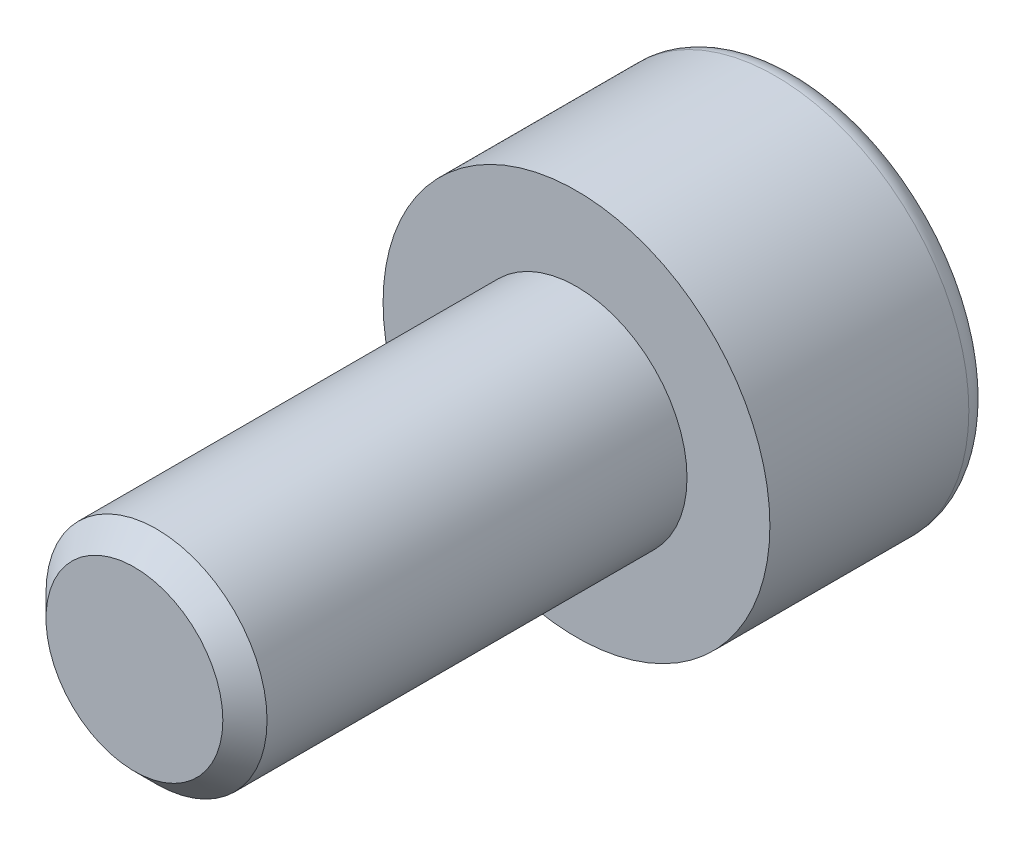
ISO-10303-21;
HEADER;
FILE_DESCRIPTION(('STEP AP214'),'2;1');
FILE_NAME('part.step','',(''),(''),'','','');
FILE_SCHEMA(('AUTOMOTIVE_DESIGN { 1 0 10303 214 1 1 1 1 }'));
ENDSEC;
DATA;
#1=APPLICATION_CONTEXT('core data for automotive mechanical design processes');
#2=APPLICATION_PROTOCOL_DEFINITION('international standard','automotive_design',2000,#1);
#3=PRODUCT_CONTEXT('',#1,'mechanical');
#4=PRODUCT('Part','Part','',(#3));
#5=PRODUCT_RELATED_PRODUCT_CATEGORY('part','',(#4));
#6=PRODUCT_DEFINITION_FORMATION('','',#4);
#7=PRODUCT_DEFINITION_CONTEXT('part definition',#1,'design');
#8=PRODUCT_DEFINITION('design','',#6,#7);
#9=PRODUCT_DEFINITION_SHAPE('','',#8);
#10=(LENGTH_UNIT() NAMED_UNIT(*) SI_UNIT(.MILLI.,.METRE.));
#11=(NAMED_UNIT(*) PLANE_ANGLE_UNIT() SI_UNIT($,.RADIAN.));
#12=(NAMED_UNIT(*) SI_UNIT($,.STERADIAN.) SOLID_ANGLE_UNIT());
#13=UNCERTAINTY_MEASURE_WITH_UNIT(LENGTH_MEASURE(1.E-05),#10,'distance_accuracy_value','');
#14=(GEOMETRIC_REPRESENTATION_CONTEXT(3) GLOBAL_UNCERTAINTY_ASSIGNED_CONTEXT((#13)) GLOBAL_UNIT_ASSIGNED_CONTEXT((#10,
#11,#12)) REPRESENTATION_CONTEXT('',''));
#15=CARTESIAN_POINT('',(0.,0.,0.));
#16=DIRECTION('',(0.,0.,1.));
#17=DIRECTION('',(1.,0.,0.));
#18=AXIS2_PLACEMENT_3D('',#15,#16,#17);
#19=CARTESIAN_POINT('',(0.,0.,-4.));
#20=DIRECTION('',(0.,0.,1.));
#21=DIRECTION('',(1.,0.,0.));
#22=AXIS2_PLACEMENT_3D('',#19,#20,#21);
#23=PLANE('',#22);
#24=CARTESIAN_POINT('',(0.,0.,-4.));
#25=DIRECTION('',(0.,0.,-1.));
#26=DIRECTION('',(-1.,0.,0.));
#27=AXIS2_PLACEMENT_3D('',#24,#25,#26);
#28=CIRCLE('',#27,3.1);
#29=CARTESIAN_POINT('',(-3.1,0.,-4.));
#30=VERTEX_POINT('',#29);
#31=EDGE_CURVE('E138',#30,#30,#28,.T.);
#32=ORIENTED_EDGE('',*,*,#31,.T.);
#33=EDGE_LOOP('',(#32));
#34=FACE_BOUND('',#33,.T.);
#35=DIRECTION('',(-0.86602540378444,0.499999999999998,0.));
#36=VECTOR('',#35,1.);
#37=CARTESIAN_POINT('',(0.,1.73205080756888,-4.));
#38=LINE('',#37,#36);
#39=CARTESIAN_POINT('',(1.5,0.866025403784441,-4.));
#40=VERTEX_POINT('',#39);
#41=CARTESIAN_POINT('',(0.,1.73205080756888,-4.));
#42=VERTEX_POINT('',#41);
#43=EDGE_CURVE('E42',#40,#42,#38,.T.);
#44=ORIENTED_EDGE('',*,*,#43,.T.);
#45=DIRECTION('',(-0.866025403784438,-0.500000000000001,0.));
#46=VECTOR('',#45,1.);
#47=CARTESIAN_POINT('',(0.,1.73205080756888,-4.));
#48=LINE('',#47,#46);
#49=CARTESIAN_POINT('',(-1.5,0.866025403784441,-4.));
#50=VERTEX_POINT('',#49);
#51=EDGE_CURVE('E82',#42,#50,#48,.T.);
#52=ORIENTED_EDGE('',*,*,#51,.T.);
#53=DIRECTION('',(0.,-1.,0.));
#54=VECTOR('',#53,1.);
#55=CARTESIAN_POINT('',(-1.5,-0.866025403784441,-4.));
#56=LINE('',#55,#54);
#57=CARTESIAN_POINT('',(-1.5,-0.866025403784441,-4.));
#58=VERTEX_POINT('',#57);
#59=EDGE_CURVE('E90',#50,#58,#56,.T.);
#60=ORIENTED_EDGE('',*,*,#59,.T.);
#61=DIRECTION('',(0.866025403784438,-0.500000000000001,0.));
#62=VECTOR('',#61,1.);
#63=CARTESIAN_POINT('',(0.,-1.73205080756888,-4.));
#64=LINE('',#63,#62);
#65=CARTESIAN_POINT('',(0.,-1.73205080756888,-4.));
#66=VERTEX_POINT('',#65);
#67=EDGE_CURVE('E108',#58,#66,#64,.T.);
#68=ORIENTED_EDGE('',*,*,#67,.T.);
#69=DIRECTION('',(0.86602540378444,0.499999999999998,0.));
#70=VECTOR('',#69,1.);
#71=CARTESIAN_POINT('',(0.,-1.73205080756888,-4.));
#72=LINE('',#71,#70);
#73=CARTESIAN_POINT('',(1.5,-0.866025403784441,-4.));
#74=VERTEX_POINT('',#73);
#75=EDGE_CURVE('E111',#66,#74,#72,.T.);
#76=ORIENTED_EDGE('',*,*,#75,.T.);
#77=DIRECTION('',(0.,1.,0.));
#78=VECTOR('',#77,1.);
#79=CARTESIAN_POINT('',(1.5,-0.866025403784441,-4.));
#80=LINE('',#79,#78);
#81=EDGE_CURVE('E101',#74,#40,#80,.T.);
#82=ORIENTED_EDGE('',*,*,#81,.T.);
#83=EDGE_LOOP('',(#44,#52,#60,#68,#76,#82));
#84=FACE_BOUND('',#83,.T.);
#85=ADVANCED_FACE('F28',(#34,#84),#23,.F.);
#86=CARTESIAN_POINT('',(0.,0.,-3.6));
#87=DIRECTION('',(0.,0.,-1.));
#88=DIRECTION('',(-1.,0.,0.));
#89=AXIS2_PLACEMENT_3D('',#86,#87,#88);
#90=TOROIDAL_SURFACE('',#89,3.1,0.4);
#91=ORIENTED_EDGE('',*,*,#31,.F.);
#92=EDGE_LOOP('',(#91));
#93=FACE_BOUND('',#92,.T.);
#94=CARTESIAN_POINT('',(0.,0.,-3.6));
#95=DIRECTION('',(0.,0.,-1.));
#96=DIRECTION('',(-1.,0.,0.));
#97=AXIS2_PLACEMENT_3D('',#94,#95,#96);
#98=CIRCLE('',#97,3.5);
#99=CARTESIAN_POINT('',(-3.5,0.,-3.6));
#100=VERTEX_POINT('',#99);
#101=EDGE_CURVE('E135',#100,#100,#98,.T.);
#102=ORIENTED_EDGE('',*,*,#101,.T.);
#103=EDGE_LOOP('',(#102));
#104=FACE_BOUND('',#103,.T.);
#105=ADVANCED_FACE('F157',(#93,#104),#90,.T.);
#106=CARTESIAN_POINT('',(0.,0.,0.));
#107=DIRECTION('',(0.,0.,-1.));
#108=DIRECTION('',(-1.,0.,0.));
#109=AXIS2_PLACEMENT_3D('',#106,#107,#108);
#110=CYLINDRICAL_SURFACE('',#109,3.5);
#111=ORIENTED_EDGE('',*,*,#101,.F.);
#112=EDGE_LOOP('',(#111));
#113=FACE_BOUND('',#112,.T.);
#114=CARTESIAN_POINT('',(0.,0.,0.));
#115=DIRECTION('',(0.,0.,-1.));
#116=DIRECTION('',(-1.,0.,0.));
#117=AXIS2_PLACEMENT_3D('',#114,#115,#116);
#118=CIRCLE('',#117,3.5);
#119=CARTESIAN_POINT('',(-3.5,0.,0.));
#120=VERTEX_POINT('',#119);
#121=EDGE_CURVE('E96',#120,#120,#118,.T.);
#122=ORIENTED_EDGE('',*,*,#121,.T.);
#123=EDGE_LOOP('',(#122));
#124=FACE_BOUND('',#123,.T.);
#125=ADVANCED_FACE('F162',(#113,#124),#110,.T.);
#126=CARTESIAN_POINT('',(0.,0.,0.));
#127=DIRECTION('',(0.,0.,-1.));
#128=DIRECTION('',(-1.,0.,0.));
#129=AXIS2_PLACEMENT_3D('',#126,#127,#128);
#130=PLANE('',#129);
#131=CARTESIAN_POINT('',(0.,0.,0.));
#132=DIRECTION('',(0.,0.,1.));
#133=DIRECTION('',(1.,0.,0.));
#134=AXIS2_PLACEMENT_3D('',#131,#132,#133);
#135=CIRCLE('',#134,2.);
#136=CARTESIAN_POINT('',(2.,0.,0.));
#137=VERTEX_POINT('',#136);
#138=EDGE_CURVE('E102',#137,#137,#135,.T.);
#139=ORIENTED_EDGE('',*,*,#138,.F.);
#140=EDGE_LOOP('',(#139));
#141=FACE_BOUND('',#140,.T.);
#142=ORIENTED_EDGE('',*,*,#121,.F.);
#143=EDGE_LOOP('',(#142));
#144=FACE_BOUND('',#143,.T.);
#145=ADVANCED_FACE('F170',(#141,#144),#130,.F.);
#146=CARTESIAN_POINT('',(0.,1.73205080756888,-2.));
#147=DIRECTION('',(-0.499999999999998,-0.86602540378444,0.));
#148=DIRECTION('',(0.86602540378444,-0.499999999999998,0.));
#149=AXIS2_PLACEMENT_3D('',#146,#147,#148);
#150=PLANE('',#149);
#151=ORIENTED_EDGE('',*,*,#43,.F.);
#152=DIRECTION('',(0.,0.,-1.));
#153=VECTOR('',#152,1.);
#154=CARTESIAN_POINT('',(1.5,0.866025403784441,-2.));
#155=LINE('',#154,#153);
#156=CARTESIAN_POINT('',(1.5,0.866025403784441,-2.));
#157=VERTEX_POINT('',#156);
#158=EDGE_CURVE('E124',#157,#40,#155,.T.);
#159=ORIENTED_EDGE('',*,*,#158,.F.);
#160=DIRECTION('',(-0.86602540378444,0.499999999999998,0.));
#161=VECTOR('',#160,1.);
#162=CARTESIAN_POINT('',(0.,1.73205080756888,-2.));
#163=LINE('',#162,#161);
#164=CARTESIAN_POINT('',(0.,1.73205080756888,-2.));
#165=VERTEX_POINT('',#164);
#166=EDGE_CURVE('E95',#157,#165,#163,.T.);
#167=ORIENTED_EDGE('',*,*,#166,.T.);
#168=DIRECTION('',(0.,0.,-1.));
#169=VECTOR('',#168,1.);
#170=CARTESIAN_POINT('',(0.,1.73205080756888,-2.));
#171=LINE('',#170,#169);
#172=EDGE_CURVE('E84',#165,#42,#171,.T.);
#173=ORIENTED_EDGE('',*,*,#172,.T.);
#174=EDGE_LOOP('',(#151,#159,#167,#173));
#175=FACE_BOUND('',#174,.T.);
#176=ADVANCED_FACE('F93',(#175),#150,.T.);
#177=CARTESIAN_POINT('',(0.,1.73205080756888,-2.));
#178=DIRECTION('',(0.500000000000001,-0.866025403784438,0.));
#179=DIRECTION('',(0.866025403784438,0.500000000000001,0.));
#180=AXIS2_PLACEMENT_3D('',#177,#178,#179);
#181=PLANE('',#180);
#182=ORIENTED_EDGE('',*,*,#51,.F.);
#183=ORIENTED_EDGE('',*,*,#172,.F.);
#184=DIRECTION('',(-0.866025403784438,-0.500000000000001,0.));
#185=VECTOR('',#184,1.);
#186=CARTESIAN_POINT('',(0.,1.73205080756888,-2.));
#187=LINE('',#186,#185);
#188=CARTESIAN_POINT('',(-1.5,0.866025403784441,-2.));
#189=VERTEX_POINT('',#188);
#190=EDGE_CURVE('E115',#165,#189,#187,.T.);
#191=ORIENTED_EDGE('',*,*,#190,.T.);
#192=DIRECTION('',(0.,0.,-1.));
#193=VECTOR('',#192,1.);
#194=CARTESIAN_POINT('',(-1.5,0.866025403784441,-2.));
#195=LINE('',#194,#193);
#196=EDGE_CURVE('E86',#189,#50,#195,.T.);
#197=ORIENTED_EDGE('',*,*,#196,.T.);
#198=EDGE_LOOP('',(#182,#183,#191,#197));
#199=FACE_BOUND('',#198,.T.);
#200=ADVANCED_FACE('F83',(#199),#181,.T.);
#201=CARTESIAN_POINT('',(-1.5,-0.866025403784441,-2.));
#202=DIRECTION('',(1.,0.,0.));
#203=DIRECTION('',(0.,0.,-1.));
#204=AXIS2_PLACEMENT_3D('',#201,#202,#203);
#205=PLANE('',#204);
#206=ORIENTED_EDGE('',*,*,#59,.F.);
#207=ORIENTED_EDGE('',*,*,#196,.F.);
#208=DIRECTION('',(0.,-1.,0.));
#209=VECTOR('',#208,1.);
#210=CARTESIAN_POINT('',(-1.5,-0.866025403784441,-2.));
#211=LINE('',#210,#209);
#212=CARTESIAN_POINT('',(-1.5,-0.866025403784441,-2.));
#213=VERTEX_POINT('',#212);
#214=EDGE_CURVE('E117',#189,#213,#211,.T.);
#215=ORIENTED_EDGE('',*,*,#214,.T.);
#216=DIRECTION('',(0.,0.,-1.));
#217=VECTOR('',#216,1.);
#218=CARTESIAN_POINT('',(-1.5,-0.866025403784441,-2.));
#219=LINE('',#218,#217);
#220=EDGE_CURVE('E130',#213,#58,#219,.T.);
#221=ORIENTED_EDGE('',*,*,#220,.T.);
#222=EDGE_LOOP('',(#206,#207,#215,#221));
#223=FACE_BOUND('',#222,.T.);
#224=ADVANCED_FACE('F185',(#223),#205,.T.);
#225=CARTESIAN_POINT('',(0.,-1.73205080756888,-2.));
#226=DIRECTION('',(0.500000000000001,0.866025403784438,0.));
#227=DIRECTION('',(-0.866025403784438,0.500000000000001,0.));
#228=AXIS2_PLACEMENT_3D('',#225,#226,#227);
#229=PLANE('',#228);
#230=ORIENTED_EDGE('',*,*,#67,.F.);
#231=ORIENTED_EDGE('',*,*,#220,.F.);
#232=DIRECTION('',(0.866025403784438,-0.500000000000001,0.));
#233=VECTOR('',#232,1.);
#234=CARTESIAN_POINT('',(0.,-1.73205080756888,-2.));
#235=LINE('',#234,#233);
#236=CARTESIAN_POINT('',(0.,-1.73205080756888,-2.));
#237=VERTEX_POINT('',#236);
#238=EDGE_CURVE('E119',#213,#237,#235,.T.);
#239=ORIENTED_EDGE('',*,*,#238,.T.);
#240=DIRECTION('',(0.,0.,-1.));
#241=VECTOR('',#240,1.);
#242=CARTESIAN_POINT('',(0.,-1.73205080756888,-2.));
#243=LINE('',#242,#241);
#244=EDGE_CURVE('E128',#237,#66,#243,.T.);
#245=ORIENTED_EDGE('',*,*,#244,.T.);
#246=EDGE_LOOP('',(#230,#231,#239,#245));
#247=FACE_BOUND('',#246,.T.);
#248=ADVANCED_FACE('F188',(#247),#229,.T.);
#249=CARTESIAN_POINT('',(0.,-1.73205080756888,-2.));
#250=DIRECTION('',(-0.499999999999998,0.86602540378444,0.));
#251=DIRECTION('',(-0.86602540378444,-0.499999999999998,0.));
#252=AXIS2_PLACEMENT_3D('',#249,#250,#251);
#253=PLANE('',#252);
#254=ORIENTED_EDGE('',*,*,#75,.F.);
#255=ORIENTED_EDGE('',*,*,#244,.F.);
#256=DIRECTION('',(0.86602540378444,0.499999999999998,0.));
#257=VECTOR('',#256,1.);
#258=CARTESIAN_POINT('',(0.,-1.73205080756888,-2.));
#259=LINE('',#258,#257);
#260=CARTESIAN_POINT('',(1.5,-0.866025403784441,-2.));
#261=VERTEX_POINT('',#260);
#262=EDGE_CURVE('E121',#237,#261,#259,.T.);
#263=ORIENTED_EDGE('',*,*,#262,.T.);
#264=DIRECTION('',(0.,0.,-1.));
#265=VECTOR('',#264,1.);
#266=CARTESIAN_POINT('',(1.5,-0.866025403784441,-2.));
#267=LINE('',#266,#265);
#268=EDGE_CURVE('E126',#261,#74,#267,.T.);
#269=ORIENTED_EDGE('',*,*,#268,.T.);
#270=EDGE_LOOP('',(#254,#255,#263,#269));
#271=FACE_BOUND('',#270,.T.);
#272=ADVANCED_FACE('F192',(#271),#253,.T.);
#273=CARTESIAN_POINT('',(1.5,-0.866025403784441,-2.));
#274=DIRECTION('',(-1.,0.,0.));
#275=DIRECTION('',(0.,0.,1.));
#276=AXIS2_PLACEMENT_3D('',#273,#274,#275);
#277=PLANE('',#276);
#278=ORIENTED_EDGE('',*,*,#81,.F.);
#279=ORIENTED_EDGE('',*,*,#268,.F.);
#280=DIRECTION('',(0.,1.,0.));
#281=VECTOR('',#280,1.);
#282=CARTESIAN_POINT('',(1.5,-0.866025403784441,-2.));
#283=LINE('',#282,#281);
#284=EDGE_CURVE('E49',#261,#157,#283,.T.);
#285=ORIENTED_EDGE('',*,*,#284,.T.);
#286=ORIENTED_EDGE('',*,*,#158,.T.);
#287=EDGE_LOOP('',(#278,#279,#285,#286));
#288=FACE_BOUND('',#287,.T.);
#289=ADVANCED_FACE('F196',(#288),#277,.T.);
#290=CARTESIAN_POINT('',(1.5,0.866025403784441,-2.));
#291=DIRECTION('',(0.,0.,1.));
#292=DIRECTION('',(1.,0.,0.));
#293=AXIS2_PLACEMENT_3D('',#290,#291,#292);
#294=PLANE('',#293);
#295=ORIENTED_EDGE('',*,*,#166,.F.);
#296=ORIENTED_EDGE('',*,*,#284,.F.);
#297=ORIENTED_EDGE('',*,*,#262,.F.);
#298=ORIENTED_EDGE('',*,*,#238,.F.);
#299=ORIENTED_EDGE('',*,*,#214,.F.);
#300=ORIENTED_EDGE('',*,*,#190,.F.);
#301=EDGE_LOOP('',(#295,#296,#297,#298,#299,#300));
#302=FACE_BOUND('',#301,.T.);
#303=ADVANCED_FACE('F200',(#302),#294,.F.);
#304=CARTESIAN_POINT('',(0.,0.,8.));
#305=DIRECTION('',(0.,0.,1.));
#306=DIRECTION('',(1.,0.,0.));
#307=AXIS2_PLACEMENT_3D('',#304,#305,#306);
#308=PLANE('',#307);
#309=CARTESIAN_POINT('',(0.,0.,8.));
#310=DIRECTION('',(0.,0.,1.));
#311=DIRECTION('',(1.,0.,0.));
#312=AXIS2_PLACEMENT_3D('',#309,#310,#311);
#313=CIRCLE('',#312,1.6);
#314=CARTESIAN_POINT('',(1.6,0.,8.));
#315=VERTEX_POINT('',#314);
#316=EDGE_CURVE('E35',#315,#315,#313,.T.);
#317=ORIENTED_EDGE('',*,*,#316,.T.);
#318=EDGE_LOOP('',(#317));
#319=FACE_BOUND('',#318,.T.);
#320=ADVANCED_FACE('F143',(#319),#308,.T.);
#321=CARTESIAN_POINT('',(0.,0.,0.));
#322=DIRECTION('',(0.,0.,1.));
#323=DIRECTION('',(1.,0.,0.));
#324=AXIS2_PLACEMENT_3D('',#321,#322,#323);
#325=CYLINDRICAL_SURFACE('',#324,2.);
#326=CARTESIAN_POINT('',(0.,0.,7.6));
#327=DIRECTION('',(0.,0.,1.));
#328=DIRECTION('',(1.,0.,0.));
#329=AXIS2_PLACEMENT_3D('',#326,#327,#328);
#330=CIRCLE('',#329,2.);
#331=CARTESIAN_POINT('',(2.,0.,7.6));
#332=VERTEX_POINT('',#331);
#333=EDGE_CURVE('E11',#332,#332,#330,.F.);
#334=ORIENTED_EDGE('',*,*,#333,.T.);
#335=EDGE_LOOP('',(#334));
#336=FACE_BOUND('',#335,.T.);
#337=ORIENTED_EDGE('',*,*,#138,.T.);
#338=EDGE_LOOP('',(#337));
#339=FACE_BOUND('',#338,.T.);
#340=ADVANCED_FACE('F147',(#336,#339),#325,.T.);
#341=CARTESIAN_POINT('',(0.,0.,8.));
#342=DIRECTION('',(0.,0.,-1.));
#343=DIRECTION('',(-1.,0.,0.));
#344=AXIS2_PLACEMENT_3D('',#341,#342,#343);
#345=CONICAL_SURFACE('',#344,1.6,0.785398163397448);
#346=ORIENTED_EDGE('',*,*,#333,.F.);
#347=EDGE_LOOP('',(#346));
#348=FACE_BOUND('',#347,.T.);
#349=ORIENTED_EDGE('',*,*,#316,.F.);
#350=EDGE_LOOP('',(#349));
#351=FACE_BOUND('',#350,.T.);
#352=ADVANCED_FACE('F145',(#348,#351),#345,.T.);
#353=CLOSED_SHELL('',(#85,#105,#125,#145,#176,#200,#224,#248,#272,#289,#303,#320,#340,#352));
#354=MANIFOLD_SOLID_BREP('B2',#353);
#355=ADVANCED_BREP_SHAPE_REPRESENTATION('',(#18,#354),#14);
#356=SHAPE_DEFINITION_REPRESENTATION(#9,#355);
ENDSEC;
END-ISO-10303-21;
